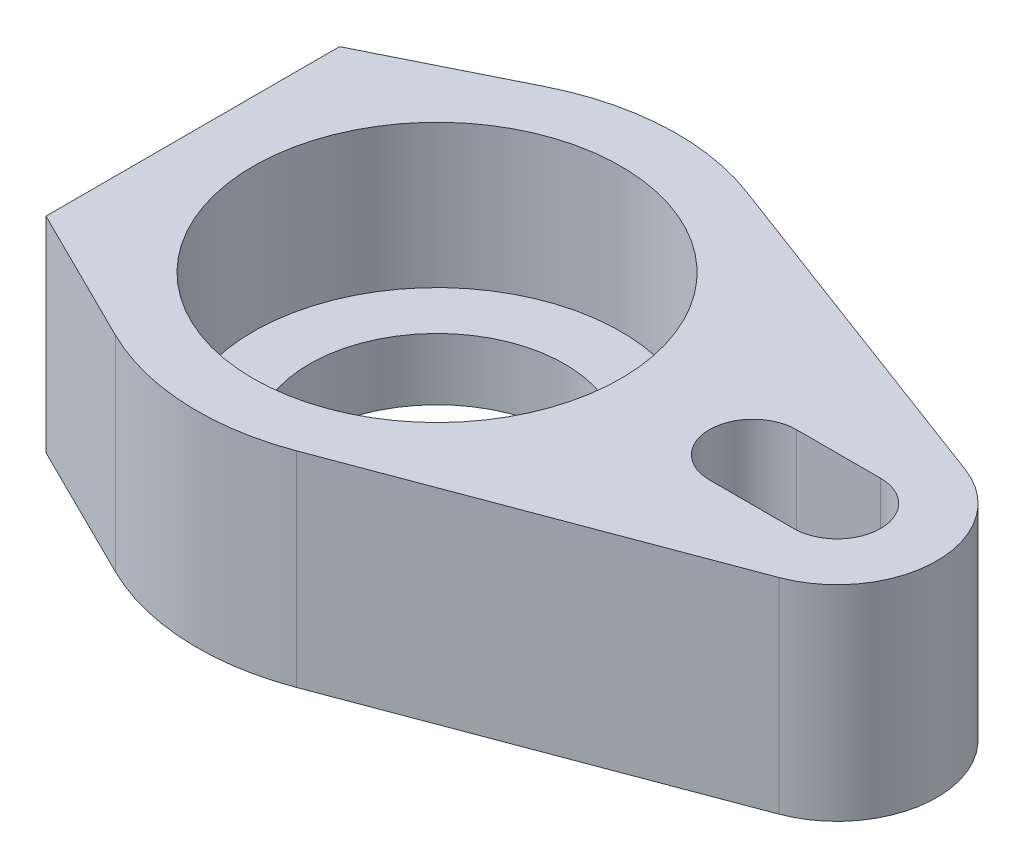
ISO-10303-21;
HEADER;
FILE_DESCRIPTION(('STEP AP214'),'2;1');
FILE_NAME('part.step','',(''),(''),'','','');
FILE_SCHEMA(('AUTOMOTIVE_DESIGN { 1 0 10303 214 1 1 1 1 }'));
ENDSEC;
DATA;
#1=APPLICATION_CONTEXT('core data for automotive mechanical design processes');
#2=APPLICATION_PROTOCOL_DEFINITION('international standard','automotive_design',2000,#1);
#3=PRODUCT_CONTEXT('',#1,'mechanical');
#4=PRODUCT('Part','Part','',(#3));
#5=PRODUCT_RELATED_PRODUCT_CATEGORY('part','',(#4));
#6=PRODUCT_DEFINITION_FORMATION('','',#4);
#7=PRODUCT_DEFINITION_CONTEXT('part definition',#1,'design');
#8=PRODUCT_DEFINITION('design','',#6,#7);
#9=PRODUCT_DEFINITION_SHAPE('','',#8);
#10=(LENGTH_UNIT() NAMED_UNIT(*) SI_UNIT(.MILLI.,.METRE.));
#11=(NAMED_UNIT(*) PLANE_ANGLE_UNIT() SI_UNIT($,.RADIAN.));
#12=(NAMED_UNIT(*) SI_UNIT($,.STERADIAN.) SOLID_ANGLE_UNIT());
#13=UNCERTAINTY_MEASURE_WITH_UNIT(LENGTH_MEASURE(1.E-05),#10,'distance_accuracy_value','');
#14=(GEOMETRIC_REPRESENTATION_CONTEXT(3) GLOBAL_UNCERTAINTY_ASSIGNED_CONTEXT((#13)) GLOBAL_UNIT_ASSIGNED_CONTEXT((#10,
#11,#12)) REPRESENTATION_CONTEXT('',''));
#15=CARTESIAN_POINT('',(0.,0.,0.));
#16=DIRECTION('',(0.,0.,1.));
#17=DIRECTION('',(1.,0.,0.));
#18=AXIS2_PLACEMENT_3D('',#15,#16,#17);
#19=CARTESIAN_POINT('',(3.,7.3,8.00640368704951));
#20=DIRECTION('',(0.350877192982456,0.,0.93642148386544));
#21=DIRECTION('',(0.93642148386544,0.,-0.350877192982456));
#22=AXIS2_PLACEMENT_3D('',#19,#20,#21);
#23=PLANE('',#22);
#24=DIRECTION('',(-0.93642148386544,0.,0.350877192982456));
#25=VECTOR('',#24,1.);
#26=CARTESIAN_POINT('',(3.,0.,8.00640368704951));
#27=LINE('',#26,#25);
#28=CARTESIAN_POINT('',(15.4956140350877,0.,3.32429626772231));
#29=VERTEX_POINT('',#28);
#30=CARTESIAN_POINT('',(3.,0.,8.00640368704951));
#31=VERTEX_POINT('',#30);
#32=EDGE_CURVE('E206',#29,#31,#27,.T.);
#33=ORIENTED_EDGE('',*,*,#32,.F.);
#34=DIRECTION('',(0.,-1.,0.));
#35=VECTOR('',#34,1.);
#36=CARTESIAN_POINT('',(15.4956140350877,7.3,3.32429626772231));
#37=LINE('',#36,#35);
#38=CARTESIAN_POINT('',(15.4956140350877,7.3,3.32429626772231));
#39=VERTEX_POINT('',#38);
#40=EDGE_CURVE('E52',#39,#29,#37,.T.);
#41=ORIENTED_EDGE('',*,*,#40,.F.);
#42=DIRECTION('',(-0.93642148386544,0.,0.350877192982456));
#43=VECTOR('',#42,1.);
#44=CARTESIAN_POINT('',(3.,7.3,8.00640368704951));
#45=LINE('',#44,#43);
#46=CARTESIAN_POINT('',(3.,7.3,8.00640368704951));
#47=VERTEX_POINT('',#46);
#48=EDGE_CURVE('E232',#39,#47,#45,.T.);
#49=ORIENTED_EDGE('',*,*,#48,.T.);
#50=DIRECTION('',(0.,-1.,0.));
#51=VECTOR('',#50,1.);
#52=CARTESIAN_POINT('',(3.,7.3,8.00640368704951));
#53=LINE('',#52,#51);
#54=EDGE_CURVE('E107',#47,#31,#53,.T.);
#55=ORIENTED_EDGE('',*,*,#54,.T.);
#56=EDGE_LOOP('',(#33,#41,#49,#55));
#57=FACE_BOUND('',#56,.T.);
#58=ADVANCED_FACE('F43',(#57),#23,.T.);
#59=CARTESIAN_POINT('',(14.25,7.3,0.));
#60=DIRECTION('',(0.,-1.,0.));
#61=DIRECTION('',(0.,0.,-1.));
#62=AXIS2_PLACEMENT_3D('',#59,#60,#61);
#63=CYLINDRICAL_SURFACE('',#62,3.55);
#64=CARTESIAN_POINT('',(14.25,0.,0.));
#65=DIRECTION('',(0.,1.,0.));
#66=DIRECTION('',(0.,0.,1.));
#67=AXIS2_PLACEMENT_3D('',#64,#65,#66);
#68=CIRCLE('',#67,3.55);
#69=CARTESIAN_POINT('',(15.4956140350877,0.,-3.32429626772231));
#70=VERTEX_POINT('',#69);
#71=EDGE_CURVE('E203',#29,#70,#68,.T.);
#72=ORIENTED_EDGE('',*,*,#71,.T.);
#73=DIRECTION('',(0.,-1.,0.));
#74=VECTOR('',#73,1.);
#75=CARTESIAN_POINT('',(15.4956140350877,7.3,-3.32429626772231));
#76=LINE('',#75,#74);
#77=CARTESIAN_POINT('',(15.4956140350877,7.3,-3.32429626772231));
#78=VERTEX_POINT('',#77);
#79=EDGE_CURVE('E175',#78,#70,#76,.T.);
#80=ORIENTED_EDGE('',*,*,#79,.F.);
#81=CARTESIAN_POINT('',(14.25,7.3,0.));
#82=DIRECTION('',(0.,1.,0.));
#83=DIRECTION('',(0.,0.,1.));
#84=AXIS2_PLACEMENT_3D('',#81,#82,#83);
#85=CIRCLE('',#84,3.55);
#86=EDGE_CURVE('E229',#39,#78,#85,.T.);
#87=ORIENTED_EDGE('',*,*,#86,.F.);
#88=ORIENTED_EDGE('',*,*,#40,.T.);
#89=EDGE_LOOP('',(#72,#80,#87,#88));
#90=FACE_BOUND('',#89,.T.);
#91=ADVANCED_FACE('F277',(#90),#63,.T.);
#92=CARTESIAN_POINT('',(3.,7.3,-8.00640368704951));
#93=DIRECTION('',(-0.350877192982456,0.,0.93642148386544));
#94=DIRECTION('',(0.93642148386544,0.,0.350877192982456));
#95=AXIS2_PLACEMENT_3D('',#92,#93,#94);
#96=PLANE('',#95);
#97=DIRECTION('',(-0.93642148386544,0.,-0.350877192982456));
#98=VECTOR('',#97,1.);
#99=CARTESIAN_POINT('',(3.,0.,-8.00640368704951));
#100=LINE('',#99,#98);
#101=CARTESIAN_POINT('',(3.,0.,-8.00640368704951));
#102=VERTEX_POINT('',#101);
#103=EDGE_CURVE('E200',#70,#102,#100,.T.);
#104=ORIENTED_EDGE('',*,*,#103,.T.);
#105=DIRECTION('',(0.,-1.,0.));
#106=VECTOR('',#105,1.);
#107=CARTESIAN_POINT('',(3.,7.3,-8.00640368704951));
#108=LINE('',#107,#106);
#109=CARTESIAN_POINT('',(3.,7.3,-8.00640368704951));
#110=VERTEX_POINT('',#109);
#111=EDGE_CURVE('E172',#110,#102,#108,.T.);
#112=ORIENTED_EDGE('',*,*,#111,.F.);
#113=DIRECTION('',(-0.93642148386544,0.,-0.350877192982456));
#114=VECTOR('',#113,1.);
#115=CARTESIAN_POINT('',(3.,7.3,-8.00640368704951));
#116=LINE('',#115,#114);
#117=EDGE_CURVE('E226',#78,#110,#116,.T.);
#118=ORIENTED_EDGE('',*,*,#117,.F.);
#119=ORIENTED_EDGE('',*,*,#79,.T.);
#120=EDGE_LOOP('',(#104,#112,#118,#119));
#121=FACE_BOUND('',#120,.T.);
#122=ADVANCED_FACE('F282',(#121),#96,.F.);
#123=CARTESIAN_POINT('',(0.,7.3,0.));
#124=DIRECTION('',(0.,-1.,0.));
#125=DIRECTION('',(0.,0.,-1.));
#126=AXIS2_PLACEMENT_3D('',#123,#124,#125);
#127=CYLINDRICAL_SURFACE('',#126,8.55);
#128=CARTESIAN_POINT('',(0.,0.,0.));
#129=DIRECTION('',(0.,1.,0.));
#130=DIRECTION('',(0.,0.,1.));
#131=AXIS2_PLACEMENT_3D('',#128,#129,#130);
#132=CIRCLE('',#131,8.55);
#133=CARTESIAN_POINT('',(-3.8,0.,-7.65914486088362));
#134=VERTEX_POINT('',#133);
#135=EDGE_CURVE('E197',#102,#134,#132,.T.);
#136=ORIENTED_EDGE('',*,*,#135,.T.);
#137=DIRECTION('',(0.,-1.,0.));
#138=VECTOR('',#137,1.);
#139=CARTESIAN_POINT('',(-3.8,7.3,-7.65914486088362));
#140=LINE('',#139,#138);
#141=CARTESIAN_POINT('',(-3.8,7.3,-7.65914486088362));
#142=VERTEX_POINT('',#141);
#143=EDGE_CURVE('E166',#142,#134,#140,.T.);
#144=ORIENTED_EDGE('',*,*,#143,.F.);
#145=CARTESIAN_POINT('',(0.,7.3,0.));
#146=DIRECTION('',(0.,1.,0.));
#147=DIRECTION('',(0.,0.,1.));
#148=AXIS2_PLACEMENT_3D('',#145,#146,#147);
#149=CIRCLE('',#148,8.55);
#150=EDGE_CURVE('E224',#110,#142,#149,.T.);
#151=ORIENTED_EDGE('',*,*,#150,.F.);
#152=ORIENTED_EDGE('',*,*,#111,.T.);
#153=EDGE_LOOP('',(#136,#144,#151,#152));
#154=FACE_BOUND('',#153,.T.);
#155=ADVANCED_FACE('F391',(#154),#127,.T.);
#156=CARTESIAN_POINT('',(-3.8,7.3,-7.65914486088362));
#157=DIRECTION('',(-0.444444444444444,0.,-0.895806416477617));
#158=DIRECTION('',(-0.895806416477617,0.,0.444444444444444));
#159=AXIS2_PLACEMENT_3D('',#156,#157,#158);
#160=PLANE('',#159);
#161=DIRECTION('',(0.895806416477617,0.,-0.444444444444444));
#162=VECTOR('',#161,1.);
#163=CARTESIAN_POINT('',(-3.8,0.,-7.65914486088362));
#164=LINE('',#163,#162);
#165=CARTESIAN_POINT('',(-8.7,0.,-5.22806406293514));
#166=VERTEX_POINT('',#165);
#167=EDGE_CURVE('E194',#166,#134,#164,.T.);
#168=ORIENTED_EDGE('',*,*,#167,.F.);
#169=DIRECTION('',(0.,-1.,0.));
#170=VECTOR('',#169,1.);
#171=CARTESIAN_POINT('',(-8.7,7.3,-5.22806406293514));
#172=LINE('',#171,#170);
#173=CARTESIAN_POINT('',(-8.7,7.3,-5.22806406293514));
#174=VERTEX_POINT('',#173);
#175=EDGE_CURVE('E164',#174,#166,#172,.T.);
#176=ORIENTED_EDGE('',*,*,#175,.F.);
#177=DIRECTION('',(0.895806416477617,0.,-0.444444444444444));
#178=VECTOR('',#177,1.);
#179=CARTESIAN_POINT('',(-3.8,7.3,-7.65914486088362));
#180=LINE('',#179,#178);
#181=EDGE_CURVE('E158',#174,#142,#180,.T.);
#182=ORIENTED_EDGE('',*,*,#181,.T.);
#183=ORIENTED_EDGE('',*,*,#143,.T.);
#184=EDGE_LOOP('',(#168,#176,#182,#183));
#185=FACE_BOUND('',#184,.T.);
#186=ADVANCED_FACE('F383',(#185),#160,.T.);
#187=CARTESIAN_POINT('',(-8.7,7.3,0.));
#188=DIRECTION('',(1.,0.,0.));
#189=DIRECTION('',(0.,0.,-1.));
#190=AXIS2_PLACEMENT_3D('',#187,#188,#189);
#191=PLANE('',#190);
#192=DIRECTION('',(0.,0.,1.));
#193=VECTOR('',#192,1.);
#194=CARTESIAN_POINT('',(-8.7,0.,0.));
#195=LINE('',#194,#193);
#196=CARTESIAN_POINT('',(-8.7,0.,5.22806406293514));
#197=VERTEX_POINT('',#196);
#198=EDGE_CURVE('E163',#166,#197,#195,.T.);
#199=ORIENTED_EDGE('',*,*,#198,.T.);
#200=DIRECTION('',(0.,-1.,0.));
#201=VECTOR('',#200,1.);
#202=CARTESIAN_POINT('',(-8.7,7.3,5.22806406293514));
#203=LINE('',#202,#201);
#204=CARTESIAN_POINT('',(-8.7,7.3,5.22806406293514));
#205=VERTEX_POINT('',#204);
#206=EDGE_CURVE('E148',#205,#197,#203,.T.);
#207=ORIENTED_EDGE('',*,*,#206,.F.);
#208=DIRECTION('',(0.,0.,1.));
#209=VECTOR('',#208,1.);
#210=CARTESIAN_POINT('',(-8.7,7.3,0.));
#211=LINE('',#210,#209);
#212=EDGE_CURVE('E151',#174,#205,#211,.T.);
#213=ORIENTED_EDGE('',*,*,#212,.F.);
#214=ORIENTED_EDGE('',*,*,#175,.T.);
#215=EDGE_LOOP('',(#199,#207,#213,#214));
#216=FACE_BOUND('',#215,.T.);
#217=ADVANCED_FACE('F161',(#216),#191,.F.);
#218=CARTESIAN_POINT('',(-3.8,7.3,7.65914486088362));
#219=DIRECTION('',(0.444444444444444,0.,-0.895806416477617));
#220=DIRECTION('',(-0.895806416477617,0.,-0.444444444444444));
#221=AXIS2_PLACEMENT_3D('',#218,#219,#220);
#222=PLANE('',#221);
#223=DIRECTION('',(0.895806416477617,0.,0.444444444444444));
#224=VECTOR('',#223,1.);
#225=CARTESIAN_POINT('',(-3.8,0.,7.65914486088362));
#226=LINE('',#225,#224);
#227=CARTESIAN_POINT('',(-3.8,0.,7.65914486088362));
#228=VERTEX_POINT('',#227);
#229=EDGE_CURVE('E191',#197,#228,#226,.T.);
#230=ORIENTED_EDGE('',*,*,#229,.T.);
#231=DIRECTION('',(0.,-1.,0.));
#232=VECTOR('',#231,1.);
#233=CARTESIAN_POINT('',(-3.8,7.3,7.65914486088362));
#234=LINE('',#233,#232);
#235=CARTESIAN_POINT('',(-3.8,7.3,7.65914486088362));
#236=VERTEX_POINT('',#235);
#237=EDGE_CURVE('E150',#236,#228,#234,.T.);
#238=ORIENTED_EDGE('',*,*,#237,.F.);
#239=DIRECTION('',(0.895806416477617,0.,0.444444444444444));
#240=VECTOR('',#239,1.);
#241=CARTESIAN_POINT('',(-3.8,7.3,7.65914486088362));
#242=LINE('',#241,#240);
#243=EDGE_CURVE('E143',#205,#236,#242,.T.);
#244=ORIENTED_EDGE('',*,*,#243,.F.);
#245=ORIENTED_EDGE('',*,*,#206,.T.);
#246=EDGE_LOOP('',(#230,#238,#244,#245));
#247=FACE_BOUND('',#246,.T.);
#248=ADVANCED_FACE('F146',(#247),#222,.F.);
#249=CARTESIAN_POINT('',(11.25,7.3,0.));
#250=DIRECTION('',(0.,-1.,0.));
#251=DIRECTION('',(0.,0.,-1.));
#252=AXIS2_PLACEMENT_3D('',#249,#250,#251);
#253=CYLINDRICAL_SURFACE('',#252,1.55);
#254=CARTESIAN_POINT('',(11.25,0.,0.));
#255=DIRECTION('',(0.,1.,0.));
#256=DIRECTION('',(0.,0.,1.));
#257=AXIS2_PLACEMENT_3D('',#254,#255,#256);
#258=CIRCLE('',#257,1.55);
#259=CARTESIAN_POINT('',(11.25,0.,-1.55));
#260=VERTEX_POINT('',#259);
#261=CARTESIAN_POINT('',(11.25,0.,1.55));
#262=VERTEX_POINT('',#261);
#263=EDGE_CURVE('E216',#260,#262,#258,.T.);
#264=ORIENTED_EDGE('',*,*,#263,.F.);
#265=DIRECTION('',(0.,-1.,0.));
#266=VECTOR('',#265,1.);
#267=CARTESIAN_POINT('',(11.25,7.3,-1.55));
#268=LINE('',#267,#266);
#269=CARTESIAN_POINT('',(11.25,7.3,-1.55));
#270=VERTEX_POINT('',#269);
#271=EDGE_CURVE('E114',#270,#260,#268,.T.);
#272=ORIENTED_EDGE('',*,*,#271,.F.);
#273=CARTESIAN_POINT('',(11.25,7.3,0.));
#274=DIRECTION('',(0.,1.,0.));
#275=DIRECTION('',(0.,0.,1.));
#276=AXIS2_PLACEMENT_3D('',#273,#274,#275);
#277=CIRCLE('',#276,1.55);
#278=CARTESIAN_POINT('',(11.25,7.3,1.55));
#279=VERTEX_POINT('',#278);
#280=EDGE_CURVE('E190',#270,#279,#277,.T.);
#281=ORIENTED_EDGE('',*,*,#280,.T.);
#282=DIRECTION('',(0.,-1.,0.));
#283=VECTOR('',#282,1.);
#284=CARTESIAN_POINT('',(11.25,7.3,1.55));
#285=LINE('',#284,#283);
#286=EDGE_CURVE('E179',#279,#262,#285,.T.);
#287=ORIENTED_EDGE('',*,*,#286,.T.);
#288=EDGE_LOOP('',(#264,#272,#281,#287));
#289=FACE_BOUND('',#288,.T.);
#290=ADVANCED_FACE('F45',(#289),#253,.F.);
#291=CARTESIAN_POINT('',(0.,7.3,-1.55));
#292=DIRECTION('',(0.,0.,-1.));
#293=DIRECTION('',(-1.,0.,0.));
#294=AXIS2_PLACEMENT_3D('',#291,#292,#293);
#295=PLANE('',#294);
#296=DIRECTION('',(1.,0.,0.));
#297=VECTOR('',#296,1.);
#298=CARTESIAN_POINT('',(0.,0.,-1.55));
#299=LINE('',#298,#297);
#300=CARTESIAN_POINT('',(14.25,0.,-1.55));
#301=VERTEX_POINT('',#300);
#302=EDGE_CURVE('E214',#260,#301,#299,.T.);
#303=ORIENTED_EDGE('',*,*,#302,.T.);
#304=DIRECTION('',(0.,-1.,0.));
#305=VECTOR('',#304,1.);
#306=CARTESIAN_POINT('',(14.25,7.3,-1.55));
#307=LINE('',#306,#305);
#308=CARTESIAN_POINT('',(14.25,7.3,-1.55));
#309=VERTEX_POINT('',#308);
#310=EDGE_CURVE('E184',#309,#301,#307,.T.);
#311=ORIENTED_EDGE('',*,*,#310,.F.);
#312=DIRECTION('',(1.,0.,0.));
#313=VECTOR('',#312,1.);
#314=CARTESIAN_POINT('',(0.,7.3,-1.55));
#315=LINE('',#314,#313);
#316=EDGE_CURVE('E240',#270,#309,#315,.T.);
#317=ORIENTED_EDGE('',*,*,#316,.F.);
#318=ORIENTED_EDGE('',*,*,#271,.T.);
#319=EDGE_LOOP('',(#303,#311,#317,#318));
#320=FACE_BOUND('',#319,.T.);
#321=ADVANCED_FACE('F292',(#320),#295,.F.);
#322=CARTESIAN_POINT('',(14.25,7.3,0.));
#323=DIRECTION('',(0.,-1.,0.));
#324=DIRECTION('',(0.,0.,-1.));
#325=AXIS2_PLACEMENT_3D('',#322,#323,#324);
#326=CYLINDRICAL_SURFACE('',#325,1.55);
#327=CARTESIAN_POINT('',(14.25,0.,0.));
#328=DIRECTION('',(0.,1.,0.));
#329=DIRECTION('',(0.,0.,1.));
#330=AXIS2_PLACEMENT_3D('',#327,#328,#329);
#331=CIRCLE('',#330,1.55);
#332=CARTESIAN_POINT('',(14.25,0.,1.55));
#333=VERTEX_POINT('',#332);
#334=EDGE_CURVE('E211',#333,#301,#331,.T.);
#335=ORIENTED_EDGE('',*,*,#334,.F.);
#336=DIRECTION('',(0.,-1.,0.));
#337=VECTOR('',#336,1.);
#338=CARTESIAN_POINT('',(14.25,7.3,1.55));
#339=LINE('',#338,#337);
#340=CARTESIAN_POINT('',(14.25,7.3,1.55));
#341=VERTEX_POINT('',#340);
#342=EDGE_CURVE('E181',#341,#333,#339,.T.);
#343=ORIENTED_EDGE('',*,*,#342,.F.);
#344=CARTESIAN_POINT('',(14.25,7.3,0.));
#345=DIRECTION('',(0.,1.,0.));
#346=DIRECTION('',(0.,0.,1.));
#347=AXIS2_PLACEMENT_3D('',#344,#345,#346);
#348=CIRCLE('',#347,1.55);
#349=EDGE_CURVE('E237',#341,#309,#348,.T.);
#350=ORIENTED_EDGE('',*,*,#349,.T.);
#351=ORIENTED_EDGE('',*,*,#310,.T.);
#352=EDGE_LOOP('',(#335,#343,#350,#351));
#353=FACE_BOUND('',#352,.T.);
#354=ADVANCED_FACE('F290',(#353),#326,.F.);
#355=CARTESIAN_POINT('',(0.,7.3,0.));
#356=DIRECTION('',(0.,-1.,0.));
#357=DIRECTION('',(0.,0.,-1.));
#358=AXIS2_PLACEMENT_3D('',#355,#356,#357);
#359=CYLINDRICAL_SURFACE('',#358,8.55);
#360=CARTESIAN_POINT('',(0.,0.,0.));
#361=DIRECTION('',(0.,1.,0.));
#362=DIRECTION('',(0.,0.,1.));
#363=AXIS2_PLACEMENT_3D('',#360,#361,#362);
#364=CIRCLE('',#363,8.55);
#365=EDGE_CURVE('E100',#228,#31,#364,.T.);
#366=ORIENTED_EDGE('',*,*,#365,.T.);
#367=ORIENTED_EDGE('',*,*,#54,.F.);
#368=CARTESIAN_POINT('',(0.,7.3,0.));
#369=DIRECTION('',(0.,1.,0.));
#370=DIRECTION('',(0.,0.,1.));
#371=AXIS2_PLACEMENT_3D('',#368,#369,#370);
#372=CIRCLE('',#371,8.55);
#373=EDGE_CURVE('E60',#236,#47,#372,.T.);
#374=ORIENTED_EDGE('',*,*,#373,.F.);
#375=ORIENTED_EDGE('',*,*,#237,.T.);
#376=EDGE_LOOP('',(#366,#367,#374,#375));
#377=FACE_BOUND('',#376,.T.);
#378=ADVANCED_FACE('F288',(#377),#359,.T.);
#379=CARTESIAN_POINT('',(0.,7.3,1.55));
#380=DIRECTION('',(0.,0.,-1.));
#381=DIRECTION('',(-1.,0.,0.));
#382=AXIS2_PLACEMENT_3D('',#379,#380,#381);
#383=PLANE('',#382);
#384=DIRECTION('',(1.,0.,0.));
#385=VECTOR('',#384,1.);
#386=CARTESIAN_POINT('',(0.,0.,1.55));
#387=LINE('',#386,#385);
#388=EDGE_CURVE('E208',#262,#333,#387,.T.);
#389=ORIENTED_EDGE('',*,*,#388,.F.);
#390=ORIENTED_EDGE('',*,*,#286,.F.);
#391=DIRECTION('',(1.,0.,0.));
#392=VECTOR('',#391,1.);
#393=CARTESIAN_POINT('',(0.,7.3,1.55));
#394=LINE('',#393,#392);
#395=EDGE_CURVE('E234',#279,#341,#394,.T.);
#396=ORIENTED_EDGE('',*,*,#395,.T.);
#397=ORIENTED_EDGE('',*,*,#342,.T.);
#398=EDGE_LOOP('',(#389,#390,#396,#397));
#399=FACE_BOUND('',#398,.T.);
#400=ADVANCED_FACE('F261',(#399),#383,.T.);
#401=CARTESIAN_POINT('',(0.,7.3,0.));
#402=DIRECTION('',(0.,-1.,0.));
#403=DIRECTION('',(0.,0.,-1.));
#404=AXIS2_PLACEMENT_3D('',#401,#402,#403);
#405=CYLINDRICAL_SURFACE('',#404,6.55);
#406=CARTESIAN_POINT('',(0.,2.2,0.));
#407=DIRECTION('',(0.,1.,0.));
#408=DIRECTION('',(0.,0.,1.));
#409=AXIS2_PLACEMENT_3D('',#406,#407,#408);
#410=CIRCLE('',#409,6.55);
#411=CARTESIAN_POINT('',(0.,2.2,6.55));
#412=VERTEX_POINT('',#411);
#413=EDGE_CURVE('E11',#412,#412,#410,.T.);
#414=ORIENTED_EDGE('',*,*,#413,.F.);
#415=EDGE_LOOP('',(#414));
#416=FACE_BOUND('',#415,.T.);
#417=CARTESIAN_POINT('',(0.,7.3,0.));
#418=DIRECTION('',(0.,1.,0.));
#419=DIRECTION('',(0.,0.,1.));
#420=AXIS2_PLACEMENT_3D('',#417,#418,#419);
#421=CIRCLE('',#420,6.55);
#422=CARTESIAN_POINT('',(0.,7.3,6.55));
#423=VERTEX_POINT('',#422);
#424=EDGE_CURVE('E182',#423,#423,#421,.T.);
#425=ORIENTED_EDGE('',*,*,#424,.T.);
#426=EDGE_LOOP('',(#425));
#427=FACE_BOUND('',#426,.T.);
#428=ADVANCED_FACE('F258',(#416,#427),#405,.F.);
#429=CARTESIAN_POINT('',(0.,7.3,0.));
#430=DIRECTION('',(0.,1.,0.));
#431=DIRECTION('',(0.,0.,1.));
#432=AXIS2_PLACEMENT_3D('',#429,#430,#431);
#433=PLANE('',#432);
#434=ORIENTED_EDGE('',*,*,#280,.F.);
#435=ORIENTED_EDGE('',*,*,#316,.T.);
#436=ORIENTED_EDGE('',*,*,#349,.F.);
#437=ORIENTED_EDGE('',*,*,#395,.F.);
#438=EDGE_LOOP('',(#434,#435,#436,#437));
#439=FACE_BOUND('',#438,.T.);
#440=ORIENTED_EDGE('',*,*,#48,.F.);
#441=ORIENTED_EDGE('',*,*,#86,.T.);
#442=ORIENTED_EDGE('',*,*,#117,.T.);
#443=ORIENTED_EDGE('',*,*,#150,.T.);
#444=ORIENTED_EDGE('',*,*,#181,.F.);
#445=ORIENTED_EDGE('',*,*,#212,.T.);
#446=ORIENTED_EDGE('',*,*,#243,.T.);
#447=ORIENTED_EDGE('',*,*,#373,.T.);
#448=EDGE_LOOP('',(#440,#441,#442,#443,#444,#445,#446,#447));
#449=FACE_BOUND('',#448,.T.);
#450=ORIENTED_EDGE('',*,*,#424,.F.);
#451=EDGE_LOOP('',(#450));
#452=FACE_BOUND('',#451,.T.);
#453=ADVANCED_FACE('F155',(#439,#449,#452),#433,.T.);
#454=CARTESIAN_POINT('',(0.,0.,0.));
#455=DIRECTION('',(0.,1.,0.));
#456=DIRECTION('',(0.,0.,1.));
#457=AXIS2_PLACEMENT_3D('',#454,#455,#456);
#458=PLANE('',#457);
#459=ORIENTED_EDGE('',*,*,#263,.T.);
#460=ORIENTED_EDGE('',*,*,#388,.T.);
#461=ORIENTED_EDGE('',*,*,#334,.T.);
#462=ORIENTED_EDGE('',*,*,#302,.F.);
#463=EDGE_LOOP('',(#459,#460,#461,#462));
#464=FACE_BOUND('',#463,.T.);
#465=ORIENTED_EDGE('',*,*,#32,.T.);
#466=ORIENTED_EDGE('',*,*,#365,.F.);
#467=ORIENTED_EDGE('',*,*,#229,.F.);
#468=ORIENTED_EDGE('',*,*,#198,.F.);
#469=ORIENTED_EDGE('',*,*,#167,.T.);
#470=ORIENTED_EDGE('',*,*,#135,.F.);
#471=ORIENTED_EDGE('',*,*,#103,.F.);
#472=ORIENTED_EDGE('',*,*,#71,.F.);
#473=EDGE_LOOP('',(#465,#466,#467,#468,#469,#470,#471,#472));
#474=FACE_BOUND('',#473,.T.);
#475=CARTESIAN_POINT('',(0.,0.,0.));
#476=DIRECTION('',(0.,1.,0.));
#477=DIRECTION('',(0.,0.,1.));
#478=AXIS2_PLACEMENT_3D('',#475,#476,#477);
#479=CIRCLE('',#478,4.55);
#480=CARTESIAN_POINT('',(0.,0.,4.55));
#481=VERTEX_POINT('',#480);
#482=EDGE_CURVE('E243',#481,#481,#479,.T.);
#483=ORIENTED_EDGE('',*,*,#482,.T.);
#484=EDGE_LOOP('',(#483));
#485=FACE_BOUND('',#484,.T.);
#486=ADVANCED_FACE('F265',(#464,#474,#485),#458,.F.);
#487=CARTESIAN_POINT('',(0.,2.2,0.));
#488=DIRECTION('',(0.,-1.,0.));
#489=DIRECTION('',(0.,0.,-1.));
#490=AXIS2_PLACEMENT_3D('',#487,#488,#489);
#491=CYLINDRICAL_SURFACE('',#490,4.55);
#492=CARTESIAN_POINT('',(0.,2.2,0.));
#493=DIRECTION('',(0.,1.,0.));
#494=DIRECTION('',(0.,0.,1.));
#495=AXIS2_PLACEMENT_3D('',#492,#493,#494);
#496=CIRCLE('',#495,4.55);
#497=CARTESIAN_POINT('',(0.,2.2,4.55));
#498=VERTEX_POINT('',#497);
#499=EDGE_CURVE('E219',#498,#498,#496,.T.);
#500=ORIENTED_EDGE('',*,*,#499,.T.);
#501=EDGE_LOOP('',(#500));
#502=FACE_BOUND('',#501,.T.);
#503=ORIENTED_EDGE('',*,*,#482,.F.);
#504=EDGE_LOOP('',(#503));
#505=FACE_BOUND('',#504,.T.);
#506=ADVANCED_FACE('F249',(#502,#505),#491,.F.);
#507=CARTESIAN_POINT('',(0.,2.2,0.));
#508=DIRECTION('',(0.,1.,0.));
#509=DIRECTION('',(0.,0.,1.));
#510=AXIS2_PLACEMENT_3D('',#507,#508,#509);
#511=PLANE('',#510);
#512=ORIENTED_EDGE('',*,*,#499,.F.);
#513=EDGE_LOOP('',(#512));
#514=FACE_BOUND('',#513,.T.);
#515=ORIENTED_EDGE('',*,*,#413,.T.);
#516=EDGE_LOOP('',(#515));
#517=FACE_BOUND('',#516,.T.);
#518=ADVANCED_FACE('F252',(#514,#517),#511,.T.);
#519=CLOSED_SHELL('',(#58,#91,#122,#155,#186,#217,#248,#290,#321,#354,#378,#400,#428,#453,#486,
#506,#518));
#520=MANIFOLD_SOLID_BREP('B2',#519);
#521=ADVANCED_BREP_SHAPE_REPRESENTATION('',(#18,#520),#14);
#522=SHAPE_DEFINITION_REPRESENTATION(#9,#521);
ENDSEC;
END-ISO-10303-21;
